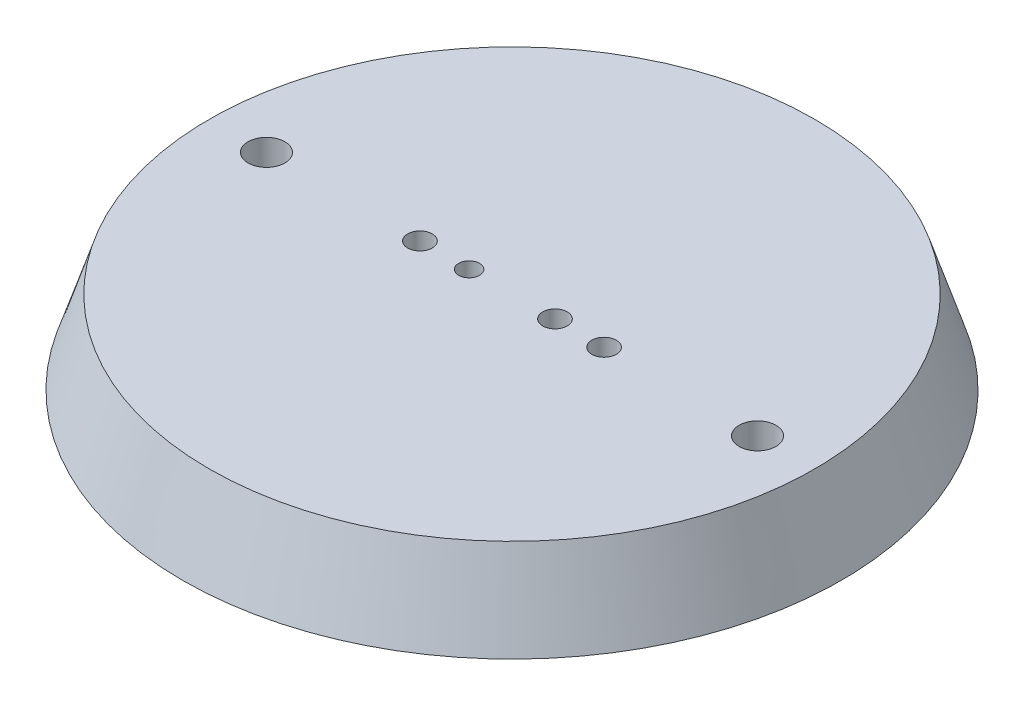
ISO-10303-21;
HEADER;
FILE_DESCRIPTION(('STEP AP214'),'2;1');
FILE_NAME('part.step','',(''),(''),'','','');
FILE_SCHEMA(('AUTOMOTIVE_DESIGN { 1 0 10303 214 1 1 1 1 }'));
ENDSEC;
DATA;
#1=APPLICATION_CONTEXT('core data for automotive mechanical design processes');
#2=APPLICATION_PROTOCOL_DEFINITION('international standard','automotive_design',2000,#1);
#3=PRODUCT_CONTEXT('',#1,'mechanical');
#4=PRODUCT('Part','Part','',(#3));
#5=PRODUCT_RELATED_PRODUCT_CATEGORY('part','',(#4));
#6=PRODUCT_DEFINITION_FORMATION('','',#4);
#7=PRODUCT_DEFINITION_CONTEXT('part definition',#1,'design');
#8=PRODUCT_DEFINITION('design','',#6,#7);
#9=PRODUCT_DEFINITION_SHAPE('','',#8);
#10=(LENGTH_UNIT() NAMED_UNIT(*) SI_UNIT(.MILLI.,.METRE.));
#11=(NAMED_UNIT(*) PLANE_ANGLE_UNIT() SI_UNIT($,.RADIAN.));
#12=(NAMED_UNIT(*) SI_UNIT($,.STERADIAN.) SOLID_ANGLE_UNIT());
#13=UNCERTAINTY_MEASURE_WITH_UNIT(LENGTH_MEASURE(1.E-05),#10,'distance_accuracy_value','');
#14=(GEOMETRIC_REPRESENTATION_CONTEXT(3) GLOBAL_UNCERTAINTY_ASSIGNED_CONTEXT((#13)) GLOBAL_UNIT_ASSIGNED_CONTEXT((#10,
#11,#12)) REPRESENTATION_CONTEXT('',''));
#15=CARTESIAN_POINT('',(0.,0.,0.));
#16=DIRECTION('',(0.,0.,1.));
#17=DIRECTION('',(1.,0.,0.));
#18=AXIS2_PLACEMENT_3D('',#15,#16,#17);
#19=CARTESIAN_POINT('',(0.,-4.81836836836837,0.));
#20=DIRECTION('',(0.,-1.,0.));
#21=DIRECTION('',(0.,0.,-1.));
#22=AXIS2_PLACEMENT_3D('',#19,#20,#21);
#23=CONICAL_SURFACE('',#22,53.6903903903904,0.311546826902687);
#24=CARTESIAN_POINT('',(0.,8.71895228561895,0.));
#25=DIRECTION('',(0.,1.,0.));
#26=DIRECTION('',(0.,0.,1.));
#27=AXIS2_PLACEMENT_3D('',#24,#25,#26);
#28=CIRCLE('',#27,49.3309142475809);
#29=CARTESIAN_POINT('',(0.,8.71895228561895,49.3309142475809));
#30=VERTEX_POINT('',#29);
#31=EDGE_CURVE('E10',#30,#30,#28,.T.);
#32=ORIENTED_EDGE('',*,*,#31,.F.);
#33=EDGE_LOOP('',(#32));
#34=FACE_BOUND('',#33,.T.);
#35=CARTESIAN_POINT('',(0.,-4.81836836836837,0.));
#36=DIRECTION('',(0.,1.,0.));
#37=DIRECTION('',(0.,0.,1.));
#38=AXIS2_PLACEMENT_3D('',#35,#36,#37);
#39=CIRCLE('',#38,53.6903903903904);
#40=CARTESIAN_POINT('',(0.,-4.81836836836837,53.6903903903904));
#41=VERTEX_POINT('',#40);
#42=EDGE_CURVE('E45',#41,#41,#39,.T.);
#43=ORIENTED_EDGE('',*,*,#42,.T.);
#44=EDGE_LOOP('',(#43));
#45=FACE_BOUND('',#44,.T.);
#46=ADVANCED_FACE('F27',(#34,#45),#23,.T.);
#47=CARTESIAN_POINT('',(0.,8.71895228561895,-49.3309142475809));
#48=DIRECTION('',(0.,-1.,0.));
#49=DIRECTION('',(0.,0.,-1.));
#50=AXIS2_PLACEMENT_3D('',#47,#48,#49);
#51=PLANE('',#50);
#52=CARTESIAN_POINT('',(7.,8.71895228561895,0.));
#53=DIRECTION('',(0.,1.,0.));
#54=DIRECTION('',(0.,0.,1.));
#55=AXIS2_PLACEMENT_3D('',#52,#53,#54);
#56=CIRCLE('',#55,2.);
#57=CARTESIAN_POINT('',(7.,8.71895228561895,2.));
#58=VERTEX_POINT('',#57);
#59=EDGE_CURVE('E61',#58,#58,#56,.T.);
#60=ORIENTED_EDGE('',*,*,#59,.F.);
#61=EDGE_LOOP('',(#60));
#62=FACE_BOUND('',#61,.T.);
#63=CARTESIAN_POINT('',(-6.98673748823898,8.71895228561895,0.));
#64=DIRECTION('',(0.,1.,0.));
#65=DIRECTION('',(0.,0.,1.));
#66=AXIS2_PLACEMENT_3D('',#63,#64,#65);
#67=CIRCLE('',#66,1.69953875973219);
#68=CARTESIAN_POINT('',(-6.98673748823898,8.71895228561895,1.69953875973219));
#69=VERTEX_POINT('',#68);
#70=EDGE_CURVE('E50',#69,#69,#67,.T.);
#71=ORIENTED_EDGE('',*,*,#70,.F.);
#72=EDGE_LOOP('',(#71));
#73=FACE_BOUND('',#72,.T.);
#74=CARTESIAN_POINT('',(40.,8.71895228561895,0.));
#75=DIRECTION('',(0.,-1.,0.));
#76=DIRECTION('',(0.,0.,-1.));
#77=AXIS2_PLACEMENT_3D('',#74,#75,#76);
#78=CIRCLE('',#77,3.);
#79=CARTESIAN_POINT('',(40.,8.71895228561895,-3.));
#80=VERTEX_POINT('',#79);
#81=EDGE_CURVE('E54',#80,#80,#78,.T.);
#82=ORIENTED_EDGE('',*,*,#81,.T.);
#83=EDGE_LOOP('',(#82));
#84=FACE_BOUND('',#83,.T.);
#85=CARTESIAN_POINT('',(-40.,8.71895228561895,0.));
#86=DIRECTION('',(0.,-1.,0.));
#87=DIRECTION('',(0.,0.,-1.));
#88=AXIS2_PLACEMENT_3D('',#85,#86,#87);
#89=CIRCLE('',#88,3.);
#90=CARTESIAN_POINT('',(-40.,8.71895228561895,-3.));
#91=VERTEX_POINT('',#90);
#92=EDGE_CURVE('E69',#91,#91,#89,.T.);
#93=ORIENTED_EDGE('',*,*,#92,.T.);
#94=EDGE_LOOP('',(#93));
#95=FACE_BOUND('',#94,.T.);
#96=CARTESIAN_POINT('',(15.,8.71895228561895,0.));
#97=DIRECTION('',(0.,-1.,0.));
#98=DIRECTION('',(0.,0.,-1.));
#99=AXIS2_PLACEMENT_3D('',#96,#97,#98);
#100=CIRCLE('',#99,2.);
#101=CARTESIAN_POINT('',(15.,8.71895228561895,-2.));
#102=VERTEX_POINT('',#101);
#103=EDGE_CURVE('E75',#102,#102,#100,.T.);
#104=ORIENTED_EDGE('',*,*,#103,.T.);
#105=EDGE_LOOP('',(#104));
#106=FACE_BOUND('',#105,.T.);
#107=CARTESIAN_POINT('',(-15.,8.71895228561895,0.));
#108=DIRECTION('',(0.,1.,0.));
#109=DIRECTION('',(0.,0.,1.));
#110=AXIS2_PLACEMENT_3D('',#107,#108,#109);
#111=CIRCLE('',#110,2.);
#112=CARTESIAN_POINT('',(-15.,8.71895228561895,2.));
#113=VERTEX_POINT('',#112);
#114=EDGE_CURVE('E46',#113,#113,#111,.T.);
#115=ORIENTED_EDGE('',*,*,#114,.F.);
#116=EDGE_LOOP('',(#115));
#117=FACE_BOUND('',#116,.T.);
#118=ORIENTED_EDGE('',*,*,#31,.T.);
#119=EDGE_LOOP('',(#118));
#120=FACE_BOUND('',#119,.T.);
#121=ADVANCED_FACE('F94',(#62,#73,#84,#95,#106,#117,#120),#51,.F.);
#122=CARTESIAN_POINT('',(0.,4.81836836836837,-30.4921807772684));
#123=DIRECTION('',(0.,1.,0.));
#124=DIRECTION('',(0.,0.,1.));
#125=AXIS2_PLACEMENT_3D('',#122,#123,#124);
#126=PLANE('',#125);
#127=CARTESIAN_POINT('',(7.,4.81836836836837,0.));
#128=DIRECTION('',(0.,1.,0.));
#129=DIRECTION('',(0.,0.,1.));
#130=AXIS2_PLACEMENT_3D('',#127,#128,#129);
#131=CIRCLE('',#130,2.);
#132=CARTESIAN_POINT('',(7.,4.81836836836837,2.));
#133=VERTEX_POINT('',#132);
#134=EDGE_CURVE('E30',#133,#133,#131,.T.);
#135=ORIENTED_EDGE('',*,*,#134,.T.);
#136=EDGE_LOOP('',(#135));
#137=FACE_BOUND('',#136,.T.);
#138=CARTESIAN_POINT('',(-6.98673748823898,4.81836836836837,0.));
#139=DIRECTION('',(0.,1.,0.));
#140=DIRECTION('',(0.,0.,1.));
#141=AXIS2_PLACEMENT_3D('',#138,#139,#140);
#142=CIRCLE('',#141,1.69953875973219);
#143=CARTESIAN_POINT('',(-6.98673748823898,4.81836836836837,1.69953875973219));
#144=VERTEX_POINT('',#143);
#145=EDGE_CURVE('E47',#144,#144,#142,.T.);
#146=ORIENTED_EDGE('',*,*,#145,.T.);
#147=EDGE_LOOP('',(#146));
#148=FACE_BOUND('',#147,.T.);
#149=CARTESIAN_POINT('',(15.,4.81836836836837,0.));
#150=DIRECTION('',(0.,-1.,0.));
#151=DIRECTION('',(0.,0.,-1.));
#152=AXIS2_PLACEMENT_3D('',#149,#150,#151);
#153=CIRCLE('',#152,2.);
#154=CARTESIAN_POINT('',(15.,4.81836836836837,-2.));
#155=VERTEX_POINT('',#154);
#156=EDGE_CURVE('E72',#155,#155,#153,.T.);
#157=ORIENTED_EDGE('',*,*,#156,.F.);
#158=EDGE_LOOP('',(#157));
#159=FACE_BOUND('',#158,.T.);
#160=CARTESIAN_POINT('',(-15.,4.81836836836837,0.));
#161=DIRECTION('',(0.,1.,0.));
#162=DIRECTION('',(0.,0.,1.));
#163=AXIS2_PLACEMENT_3D('',#160,#161,#162);
#164=CIRCLE('',#163,2.);
#165=CARTESIAN_POINT('',(-15.,4.81836836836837,2.));
#166=VERTEX_POINT('',#165);
#167=EDGE_CURVE('E43',#166,#166,#164,.T.);
#168=ORIENTED_EDGE('',*,*,#167,.T.);
#169=EDGE_LOOP('',(#168));
#170=FACE_BOUND('',#169,.T.);
#171=CARTESIAN_POINT('',(0.,4.81836836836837,0.));
#172=DIRECTION('',(0.,1.,0.));
#173=DIRECTION('',(0.,0.,1.));
#174=AXIS2_PLACEMENT_3D('',#171,#172,#173);
#175=CIRCLE('',#174,30.4921807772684);
#176=CARTESIAN_POINT('',(0.,4.81836836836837,30.4921807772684));
#177=VERTEX_POINT('',#176);
#178=EDGE_CURVE('E34',#177,#177,#175,.T.);
#179=ORIENTED_EDGE('',*,*,#178,.F.);
#180=EDGE_LOOP('',(#179));
#181=FACE_BOUND('',#180,.T.);
#182=ADVANCED_FACE('F89',(#137,#148,#159,#170,#181),#126,.F.);
#183=CARTESIAN_POINT('',(0.,45.4303303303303,0.));
#184=DIRECTION('',(0.,1.,0.));
#185=DIRECTION('',(0.,0.,1.));
#186=AXIS2_PLACEMENT_3D('',#183,#184,#185);
#187=CYLINDRICAL_SURFACE('',#186,30.4921807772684);
#188=CARTESIAN_POINT('',(0.,-4.81836836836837,0.));
#189=DIRECTION('',(0.,1.,0.));
#190=DIRECTION('',(0.,0.,1.));
#191=AXIS2_PLACEMENT_3D('',#188,#189,#190);
#192=CIRCLE('',#191,30.4921807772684);
#193=CARTESIAN_POINT('',(0.,-4.81836836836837,30.4921807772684));
#194=VERTEX_POINT('',#193);
#195=EDGE_CURVE('E39',#194,#194,#192,.T.);
#196=ORIENTED_EDGE('',*,*,#195,.F.);
#197=EDGE_LOOP('',(#196));
#198=FACE_BOUND('',#197,.T.);
#199=ORIENTED_EDGE('',*,*,#178,.T.);
#200=EDGE_LOOP('',(#199));
#201=FACE_BOUND('',#200,.T.);
#202=ADVANCED_FACE('F86',(#198,#201),#187,.F.);
#203=CARTESIAN_POINT('',(0.,-4.81836836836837,-53.6903903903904));
#204=DIRECTION('',(0.,1.,0.));
#205=DIRECTION('',(0.,0.,1.));
#206=AXIS2_PLACEMENT_3D('',#203,#204,#205);
#207=PLANE('',#206);
#208=CARTESIAN_POINT('',(40.,-4.81836836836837,0.));
#209=DIRECTION('',(0.,-1.,0.));
#210=DIRECTION('',(0.,0.,-1.));
#211=AXIS2_PLACEMENT_3D('',#208,#209,#210);
#212=CIRCLE('',#211,3.);
#213=CARTESIAN_POINT('',(40.,-4.81836836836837,-3.));
#214=VERTEX_POINT('',#213);
#215=EDGE_CURVE('E49',#214,#214,#212,.T.);
#216=ORIENTED_EDGE('',*,*,#215,.F.);
#217=EDGE_LOOP('',(#216));
#218=FACE_BOUND('',#217,.T.);
#219=CARTESIAN_POINT('',(-40.,-4.81836836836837,0.));
#220=DIRECTION('',(0.,-1.,0.));
#221=DIRECTION('',(0.,0.,-1.));
#222=AXIS2_PLACEMENT_3D('',#219,#220,#221);
#223=CIRCLE('',#222,3.);
#224=CARTESIAN_POINT('',(-40.,-4.81836836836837,-3.));
#225=VERTEX_POINT('',#224);
#226=EDGE_CURVE('E66',#225,#225,#223,.T.);
#227=ORIENTED_EDGE('',*,*,#226,.F.);
#228=EDGE_LOOP('',(#227));
#229=FACE_BOUND('',#228,.T.);
#230=ORIENTED_EDGE('',*,*,#42,.F.);
#231=EDGE_LOOP('',(#230));
#232=FACE_BOUND('',#231,.T.);
#233=ORIENTED_EDGE('',*,*,#195,.T.);
#234=EDGE_LOOP('',(#233));
#235=FACE_BOUND('',#234,.T.);
#236=ADVANCED_FACE('F84',(#218,#229,#232,#235),#207,.F.);
#237=CARTESIAN_POINT('',(-15.,-4.81836836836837,0.));
#238=DIRECTION('',(0.,1.,0.));
#239=DIRECTION('',(0.,0.,1.));
#240=AXIS2_PLACEMENT_3D('',#237,#238,#239);
#241=CYLINDRICAL_SURFACE('',#240,2.);
#242=ORIENTED_EDGE('',*,*,#114,.T.);
#243=EDGE_LOOP('',(#242));
#244=FACE_BOUND('',#243,.T.);
#245=ORIENTED_EDGE('',*,*,#167,.F.);
#246=EDGE_LOOP('',(#245));
#247=FACE_BOUND('',#246,.T.);
#248=ADVANCED_FACE('F110',(#244,#247),#241,.F.);
#249=CARTESIAN_POINT('',(15.,8.71895228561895,0.));
#250=DIRECTION('',(0.,-1.,0.));
#251=DIRECTION('',(0.,0.,-1.));
#252=AXIS2_PLACEMENT_3D('',#249,#250,#251);
#253=CYLINDRICAL_SURFACE('',#252,2.);
#254=ORIENTED_EDGE('',*,*,#103,.F.);
#255=EDGE_LOOP('',(#254));
#256=FACE_BOUND('',#255,.T.);
#257=ORIENTED_EDGE('',*,*,#156,.T.);
#258=EDGE_LOOP('',(#257));
#259=FACE_BOUND('',#258,.T.);
#260=ADVANCED_FACE('F118',(#256,#259),#253,.F.);
#261=CARTESIAN_POINT('',(-40.,8.71895228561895,0.));
#262=DIRECTION('',(0.,-1.,0.));
#263=DIRECTION('',(0.,0.,-1.));
#264=AXIS2_PLACEMENT_3D('',#261,#262,#263);
#265=CYLINDRICAL_SURFACE('',#264,3.);
#266=ORIENTED_EDGE('',*,*,#92,.F.);
#267=EDGE_LOOP('',(#266));
#268=FACE_BOUND('',#267,.T.);
#269=ORIENTED_EDGE('',*,*,#226,.T.);
#270=EDGE_LOOP('',(#269));
#271=FACE_BOUND('',#270,.T.);
#272=ADVANCED_FACE('F126',(#268,#271),#265,.F.);
#273=CARTESIAN_POINT('',(40.,8.71895228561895,0.));
#274=DIRECTION('',(0.,-1.,0.));
#275=DIRECTION('',(0.,0.,-1.));
#276=AXIS2_PLACEMENT_3D('',#273,#274,#275);
#277=CYLINDRICAL_SURFACE('',#276,3.);
#278=ORIENTED_EDGE('',*,*,#81,.F.);
#279=EDGE_LOOP('',(#278));
#280=FACE_BOUND('',#279,.T.);
#281=ORIENTED_EDGE('',*,*,#215,.T.);
#282=EDGE_LOOP('',(#281));
#283=FACE_BOUND('',#282,.T.);
#284=ADVANCED_FACE('F129',(#280,#283),#277,.F.);
#285=CARTESIAN_POINT('',(-6.98673748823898,-4.81836836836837,0.));
#286=DIRECTION('',(0.,1.,0.));
#287=DIRECTION('',(0.,0.,1.));
#288=AXIS2_PLACEMENT_3D('',#285,#286,#287);
#289=CYLINDRICAL_SURFACE('',#288,1.69953875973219);
#290=ORIENTED_EDGE('',*,*,#70,.T.);
#291=EDGE_LOOP('',(#290));
#292=FACE_BOUND('',#291,.T.);
#293=ORIENTED_EDGE('',*,*,#145,.F.);
#294=EDGE_LOOP('',(#293));
#295=FACE_BOUND('',#294,.T.);
#296=ADVANCED_FACE('F132',(#292,#295),#289,.F.);
#297=CARTESIAN_POINT('',(7.,-4.81836836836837,0.));
#298=DIRECTION('',(0.,1.,0.));
#299=DIRECTION('',(0.,0.,1.));
#300=AXIS2_PLACEMENT_3D('',#297,#298,#299);
#301=CYLINDRICAL_SURFACE('',#300,2.);
#302=ORIENTED_EDGE('',*,*,#59,.T.);
#303=EDGE_LOOP('',(#302));
#304=FACE_BOUND('',#303,.T.);
#305=ORIENTED_EDGE('',*,*,#134,.F.);
#306=EDGE_LOOP('',(#305));
#307=FACE_BOUND('',#306,.T.);
#308=ADVANCED_FACE('F136',(#304,#307),#301,.F.);
#309=CLOSED_SHELL('',(#46,#121,#182,#202,#236,#248,#260,#272,#284,#296,#308));
#310=MANIFOLD_SOLID_BREP('B2',#309);
#311=ADVANCED_BREP_SHAPE_REPRESENTATION('',(#18,#310),#14);
#312=SHAPE_DEFINITION_REPRESENTATION(#9,#311);
ENDSEC;
END-ISO-10303-21;
